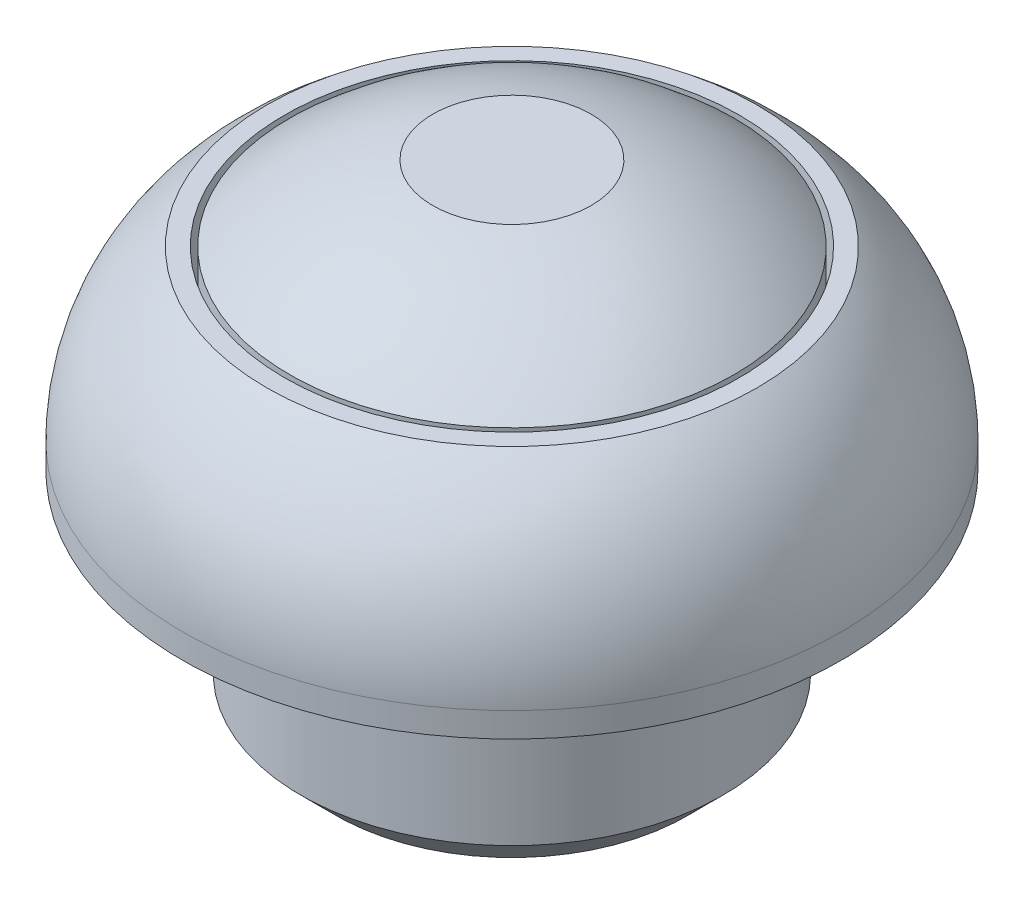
from build123d import *

# Parameters (mm, degrees)
CHAMFER1_SIZE = 1


with BuildPart() as part:
    # Sketch1 → Revolve1 (revolve)
    with BuildSketch(Plane.XY, mode=Mode.PRIVATE) as revolve1_sk:
        with BuildLine():
            Line((0, 0), (0, 6.7))
            Line((0, 6.7), (6.461893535, 6.7))
            Line((6.461893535, 6.7), (6.461893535, 11.5))
            Line((6.461893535, 11.5), (6.961893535, 11.5))
            ThreePointArc((6.961893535, 11.5), (8.728456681, 9.383281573), (9.361893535, 6.7))
            Line((9.361893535, 6.7), (9.361893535, 6))
            Line((9.361893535, 6), (6, 6))
            Line((6, 6), (6, 0))
            Line((6, 0), (0, 0))
        make_face()
        with BuildLine():
            Line((0, 7.5), (6.311893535, 7.5))
            Line((6.311893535, 7.5), (6.311893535, 11.5))
            ThreePointArc((6.311893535, 11.5), (4.411396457, 12.813654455), (2.25, 13.629707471))
            Line((2.25, 13.629707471), (0, 13.629707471))
            Line((0, 13.629707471), (0, 7.5))
        make_face()
    revolve(revolve1_sk.sketch.rotate(Axis((0, 0, 0), (0, 1, 0)), 90), axis=Axis((0, 0, 0), (0, 1, 0)))

    # Chamfer1
    chamfer1_edges = [part.edges().sort_by_distance(p)[0] for p in [
        (0, 0, 6),
    ]]
    chamfer(chamfer1_edges, length=CHAMFER1_SIZE)


solid = part.part
